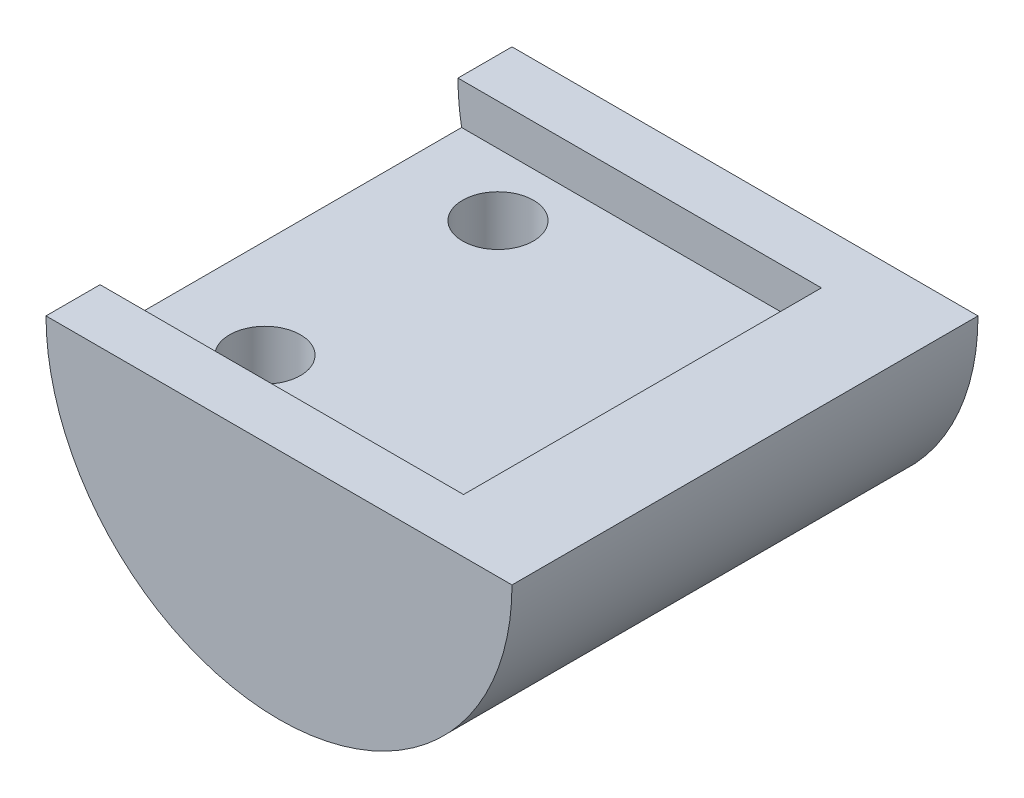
from build123d import *

# Parameters (mm, degrees)
BOSS_EXTRUDE1_DEPTH      = 15.875
BOSS_EXTRUDE1_DEPTH_BACK = 15.875
SKETCH4_W                = 24.384
SKETCH4_H                = 2.794
CUT_EXTRUDE2_DEPTH       = 24.765
SKETCH3_R                = 2.413
CUT_EXTRUDE3_DEPTH       = 28.49630657


with BuildPart() as part:
    # Sketch1 → Boss-Extrude1 (new, two sides: drawn at the far end of the back side and taken through both)
    with BuildSketch(Plane.XY.offset(-BOSS_EXTRUDE1_DEPTH_BACK)):
        with BuildLine():
            Line((-15.875, 0), (15.875, 0))
            ThreePointArc((15.875, 0), (0, -15.875), (-15.875, 0))
        make_face()
    extrude(amount=BOSS_EXTRUDE1_DEPTH + BOSS_EXTRUDE1_DEPTH_BACK)

    # Sketch4 → Cut-Extrude2 (cut)
    with BuildSketch(Plane(origin=(-15.875, 0, 0), x_dir=(0, 0, -1), z_dir=(1, 0, 0))):
        with Locations((0, -1.397)):
            Rectangle(SKETCH4_W, SKETCH4_H)
    extrude(amount=CUT_EXTRUDE2_DEPTH, mode=Mode.SUBTRACT)

    # Sketch3 → Cut-Extrude3 (cut, through all)
    with BuildSketch(Plane(origin=(0, 0, 0), x_dir=(1, 0, 0), z_dir=(0, 1, 0))):
        with Locations(Location((-8.89, 7.9375, 0), (0, 0, 270))):
            Circle(SKETCH3_R)
        with Locations(Location((-8.89, -7.9375, 0), (0, 0, 270))):
            Circle(SKETCH3_R)
    extrude(amount=-CUT_EXTRUDE3_DEPTH, mode=Mode.SUBTRACT)


solid = part.part
